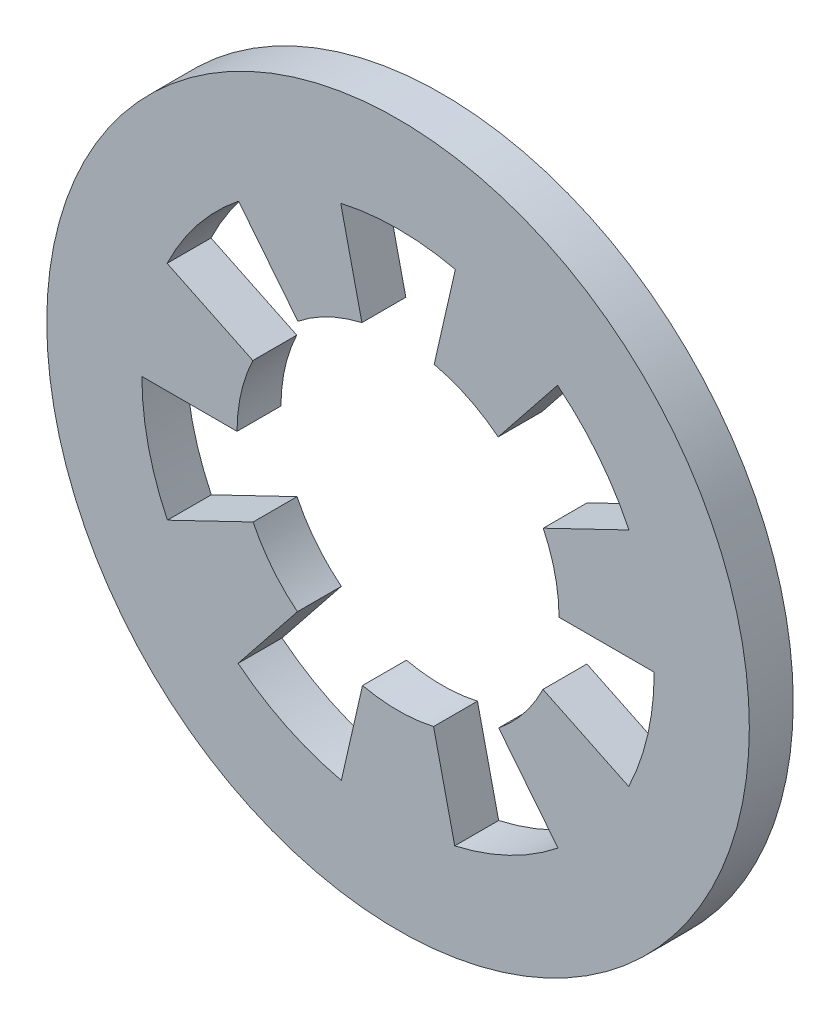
ISO-10303-21;
HEADER;
FILE_DESCRIPTION(('STEP AP214'),'2;1');
FILE_NAME('part.step','',(''),(''),'','','');
FILE_SCHEMA(('AUTOMOTIVE_DESIGN { 1 0 10303 214 1 1 1 1 }'));
ENDSEC;
DATA;
#1=APPLICATION_CONTEXT('core data for automotive mechanical design processes');
#2=APPLICATION_PROTOCOL_DEFINITION('international standard','automotive_design',2000,#1);
#3=PRODUCT_CONTEXT('',#1,'mechanical');
#4=PRODUCT('Part','Part','',(#3));
#5=PRODUCT_RELATED_PRODUCT_CATEGORY('part','',(#4));
#6=PRODUCT_DEFINITION_FORMATION('','',#4);
#7=PRODUCT_DEFINITION_CONTEXT('part definition',#1,'design');
#8=PRODUCT_DEFINITION('design','',#6,#7);
#9=PRODUCT_DEFINITION_SHAPE('','',#8);
#10=(LENGTH_UNIT() NAMED_UNIT(*) SI_UNIT(.MILLI.,.METRE.));
#11=(NAMED_UNIT(*) PLANE_ANGLE_UNIT() SI_UNIT($,.RADIAN.));
#12=(NAMED_UNIT(*) SI_UNIT($,.STERADIAN.) SOLID_ANGLE_UNIT());
#13=UNCERTAINTY_MEASURE_WITH_UNIT(LENGTH_MEASURE(1.E-05),#10,'distance_accuracy_value','');
#14=(GEOMETRIC_REPRESENTATION_CONTEXT(3) GLOBAL_UNCERTAINTY_ASSIGNED_CONTEXT((#13)) GLOBAL_UNIT_ASSIGNED_CONTEXT((#10,
#11,#12)) REPRESENTATION_CONTEXT('',''));
#15=CARTESIAN_POINT('',(0.,0.,0.));
#16=DIRECTION('',(0.,0.,1.));
#17=DIRECTION('',(1.,0.,0.));
#18=AXIS2_PLACEMENT_3D('',#15,#16,#17);
#19=CARTESIAN_POINT('',(0.,0.,0.));
#20=DIRECTION('',(0.,0.,1.));
#21=DIRECTION('',(1.,0.,0.));
#22=AXIS2_PLACEMENT_3D('',#19,#20,#21);
#23=CYLINDRICAL_SURFACE('',#22,1.1);
#24=DIRECTION('',(0.,0.,1.));
#25=VECTOR('',#24,1.);
#26=CARTESIAN_POINT('',(-0.684180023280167,0.861334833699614,-0.3));
#27=LINE('',#26,#25);
#28=CARTESIAN_POINT('',(-0.684180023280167,0.861334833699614,-0.3));
#29=VERTEX_POINT('',#28);
#30=CARTESIAN_POINT('',(-0.684180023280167,0.861334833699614,0.));
#31=VERTEX_POINT('',#30);
#32=EDGE_CURVE('E249',#29,#31,#27,.T.);
#33=ORIENTED_EDGE('',*,*,#32,.F.);
#34=CARTESIAN_POINT('',(0.,0.,-0.3));
#35=DIRECTION('',(0.,0.,1.));
#36=DIRECTION('',(1.,0.,0.));
#37=AXIS2_PLACEMENT_3D('',#34,#35,#36);
#38=CIRCLE('',#37,1.1);
#39=CARTESIAN_POINT('',(-0.246839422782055,1.07194696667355,-0.3));
#40=VERTEX_POINT('',#39);
#41=EDGE_CURVE('E11',#40,#29,#38,.T.);
#42=ORIENTED_EDGE('',*,*,#41,.F.);
#43=DIRECTION('',(0.,0.,1.));
#44=VECTOR('',#43,1.);
#45=CARTESIAN_POINT('',(-0.246839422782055,1.07194696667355,-0.3));
#46=LINE('',#45,#44);
#47=CARTESIAN_POINT('',(-0.246839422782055,1.07194696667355,0.));
#48=VERTEX_POINT('',#47);
#49=EDGE_CURVE('E408',#40,#48,#46,.T.);
#50=ORIENTED_EDGE('',*,*,#49,.T.);
#51=CARTESIAN_POINT('',(0.,0.,0.));
#52=DIRECTION('',(0.,0.,1.));
#53=DIRECTION('',(1.,0.,0.));
#54=AXIS2_PLACEMENT_3D('',#51,#52,#53);
#55=CIRCLE('',#54,1.1);
#56=EDGE_CURVE('E413',#48,#31,#55,.T.);
#57=ORIENTED_EDGE('',*,*,#56,.T.);
#58=EDGE_LOOP('',(#33,#42,#50,#57));
#59=FACE_BOUND('',#58,.T.);
#60=ADVANCED_FACE('F34',(#59),#23,.F.);
#61=DIRECTION('',(0.,0.,1.));
#62=VECTOR('',#61,1.);
#63=CARTESIAN_POINT('',(-0.991983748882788,0.475361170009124,-0.3));
#64=LINE('',#63,#62);
#65=CARTESIAN_POINT('',(-0.991983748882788,0.475361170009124,-0.3));
#66=VERTEX_POINT('',#65);
#67=CARTESIAN_POINT('',(-0.991983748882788,0.475361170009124,0.));
#68=VERTEX_POINT('',#67);
#69=EDGE_CURVE('E226',#66,#68,#64,.T.);
#70=ORIENTED_EDGE('',*,*,#69,.T.);
#71=CARTESIAN_POINT('',(-1.09999795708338,0.00212000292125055,0.));
#72=VERTEX_POINT('',#71);
#73=EDGE_CURVE('E417',#68,#72,#55,.T.);
#74=ORIENTED_EDGE('',*,*,#73,.T.);
#75=DIRECTION('',(0.,0.,1.));
#76=VECTOR('',#75,1.);
#77=CARTESIAN_POINT('',(-1.09999795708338,0.00212000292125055,-0.3));
#78=LINE('',#77,#76);
#79=CARTESIAN_POINT('',(-1.09999795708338,0.00212000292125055,-0.3));
#80=VERTEX_POINT('',#79);
#81=EDGE_CURVE('E271',#80,#72,#78,.T.);
#82=ORIENTED_EDGE('',*,*,#81,.F.);
#83=EDGE_CURVE('E42',#66,#80,#38,.T.);
#84=ORIENTED_EDGE('',*,*,#83,.F.);
#85=EDGE_LOOP('',(#70,#74,#82,#84));
#86=FACE_BOUND('',#85,.T.);
#87=ADVANCED_FACE('F444',(#86),#23,.F.);
#88=DIRECTION('',(0.,0.,1.));
#89=VECTOR('',#88,1.);
#90=CARTESIAN_POINT('',(-0.990144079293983,-0.479181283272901,-0.3));
#91=LINE('',#90,#89);
#92=CARTESIAN_POINT('',(-0.990144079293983,-0.479181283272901,-0.3));
#93=VERTEX_POINT('',#92);
#94=CARTESIAN_POINT('',(-0.990144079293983,-0.479181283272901,0.));
#95=VERTEX_POINT('',#94);
#96=EDGE_CURVE('E274',#93,#95,#91,.T.);
#97=ORIENTED_EDGE('',*,*,#96,.T.);
#98=CARTESIAN_POINT('',(-0.687494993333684,-0.858691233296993,0.));
#99=VERTEX_POINT('',#98);
#100=EDGE_CURVE('E447',#95,#99,#55,.T.);
#101=ORIENTED_EDGE('',*,*,#100,.T.);
#102=DIRECTION('',(0.,0.,1.));
#103=VECTOR('',#102,1.);
#104=CARTESIAN_POINT('',(-0.687494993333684,-0.858691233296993,-0.3));
#105=LINE('',#104,#103);
#106=CARTESIAN_POINT('',(-0.687494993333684,-0.858691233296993,-0.3));
#107=VERTEX_POINT('',#106);
#108=EDGE_CURVE('E297',#107,#99,#105,.T.);
#109=ORIENTED_EDGE('',*,*,#108,.F.);
#110=EDGE_CURVE('E432',#93,#107,#38,.T.);
#111=ORIENTED_EDGE('',*,*,#110,.F.);
#112=EDGE_LOOP('',(#97,#101,#109,#111));
#113=FACE_BOUND('',#112,.T.);
#114=ADVANCED_FACE('F500',(#113),#23,.F.);
#115=DIRECTION('',(0.,0.,1.));
#116=VECTOR('',#115,1.);
#117=CARTESIAN_POINT('',(-0.242705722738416,-1.07289045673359,-0.3));
#118=LINE('',#117,#116);
#119=CARTESIAN_POINT('',(-0.242705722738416,-1.07289045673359,-0.3));
#120=VERTEX_POINT('',#119);
#121=CARTESIAN_POINT('',(-0.242705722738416,-1.07289045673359,0.));
#122=VERTEX_POINT('',#121);
#123=EDGE_CURVE('E300',#120,#122,#118,.T.);
#124=ORIENTED_EDGE('',*,*,#123,.T.);
#125=CARTESIAN_POINT('',(0.242705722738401,-1.0728904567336,0.));
#126=VERTEX_POINT('',#125);
#127=EDGE_CURVE('E448',#122,#126,#55,.T.);
#128=ORIENTED_EDGE('',*,*,#127,.T.);
#129=DIRECTION('',(0.,0.,1.));
#130=VECTOR('',#129,1.);
#131=CARTESIAN_POINT('',(0.242705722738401,-1.0728904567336,-0.3));
#132=LINE('',#131,#130);
#133=CARTESIAN_POINT('',(0.242705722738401,-1.0728904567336,-0.3));
#134=VERTEX_POINT('',#133);
#135=EDGE_CURVE('E324',#134,#126,#132,.T.);
#136=ORIENTED_EDGE('',*,*,#135,.F.);
#137=EDGE_CURVE('E429',#120,#134,#38,.T.);
#138=ORIENTED_EDGE('',*,*,#137,.F.);
#139=EDGE_LOOP('',(#124,#128,#136,#138));
#140=FACE_BOUND('',#139,.T.);
#141=ADVANCED_FACE('F512',(#140),#23,.F.);
#142=DIRECTION('',(0.,0.,1.));
#143=VECTOR('',#142,1.);
#144=CARTESIAN_POINT('',(0.687494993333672,-0.858691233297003,-0.3));
#145=LINE('',#144,#143);
#146=CARTESIAN_POINT('',(0.687494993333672,-0.858691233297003,-0.3));
#147=VERTEX_POINT('',#146);
#148=CARTESIAN_POINT('',(0.687494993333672,-0.858691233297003,0.));
#149=VERTEX_POINT('',#148);
#150=EDGE_CURVE('E327',#147,#149,#145,.T.);
#151=ORIENTED_EDGE('',*,*,#150,.T.);
#152=CARTESIAN_POINT('',(0.990144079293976,-0.479181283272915,0.));
#153=VERTEX_POINT('',#152);
#154=EDGE_CURVE('E452',#149,#153,#55,.T.);
#155=ORIENTED_EDGE('',*,*,#154,.T.);
#156=DIRECTION('',(0.,0.,1.));
#157=VECTOR('',#156,1.);
#158=CARTESIAN_POINT('',(0.990144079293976,-0.479181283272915,-0.3));
#159=LINE('',#158,#157);
#160=CARTESIAN_POINT('',(0.990144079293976,-0.479181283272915,-0.3));
#161=VERTEX_POINT('',#160);
#162=EDGE_CURVE('E351',#161,#153,#159,.T.);
#163=ORIENTED_EDGE('',*,*,#162,.F.);
#164=EDGE_CURVE('E426',#147,#161,#38,.T.);
#165=ORIENTED_EDGE('',*,*,#164,.F.);
#166=EDGE_LOOP('',(#151,#155,#163,#165));
#167=FACE_BOUND('',#166,.T.);
#168=ADVANCED_FACE('F508',(#167),#23,.F.);
#169=DIRECTION('',(0.,0.,1.));
#170=VECTOR('',#169,1.);
#171=CARTESIAN_POINT('',(1.09999795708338,0.0021200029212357,-0.3));
#172=LINE('',#171,#170);
#173=CARTESIAN_POINT('',(1.09999795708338,0.0021200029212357,-0.3));
#174=VERTEX_POINT('',#173);
#175=CARTESIAN_POINT('',(1.09999795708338,0.0021200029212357,0.));
#176=VERTEX_POINT('',#175);
#177=EDGE_CURVE('E354',#174,#176,#172,.T.);
#178=ORIENTED_EDGE('',*,*,#177,.T.);
#179=CARTESIAN_POINT('',(0.991983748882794,0.47536117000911,0.));
#180=VERTEX_POINT('',#179);
#181=EDGE_CURVE('E456',#176,#180,#55,.T.);
#182=ORIENTED_EDGE('',*,*,#181,.T.);
#183=DIRECTION('',(0.,0.,1.));
#184=VECTOR('',#183,1.);
#185=CARTESIAN_POINT('',(0.991983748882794,0.47536117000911,-0.3));
#186=LINE('',#185,#184);
#187=CARTESIAN_POINT('',(0.991983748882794,0.47536117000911,-0.3));
#188=VERTEX_POINT('',#187);
#189=EDGE_CURVE('E378',#188,#180,#186,.T.);
#190=ORIENTED_EDGE('',*,*,#189,.F.);
#191=EDGE_CURVE('E423',#174,#188,#38,.T.);
#192=ORIENTED_EDGE('',*,*,#191,.F.);
#193=EDGE_LOOP('',(#178,#182,#190,#192));
#194=FACE_BOUND('',#193,.T.);
#195=ADVANCED_FACE('F502',(#194),#23,.F.);
#196=DIRECTION('',(0.,0.,1.));
#197=VECTOR('',#196,1.);
#198=CARTESIAN_POINT('',(0.68418002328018,0.861334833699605,-0.3));
#199=LINE('',#198,#197);
#200=CARTESIAN_POINT('',(0.68418002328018,0.861334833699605,-0.3));
#201=VERTEX_POINT('',#200);
#202=CARTESIAN_POINT('',(0.68418002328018,0.861334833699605,0.));
#203=VERTEX_POINT('',#202);
#204=EDGE_CURVE('E381',#201,#203,#199,.T.);
#205=ORIENTED_EDGE('',*,*,#204,.T.);
#206=CARTESIAN_POINT('',(0.246839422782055,1.07194696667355,0.));
#207=VERTEX_POINT('',#206);
#208=EDGE_CURVE('E404',#203,#207,#55,.T.);
#209=ORIENTED_EDGE('',*,*,#208,.T.);
#210=DIRECTION('',(0.,0.,1.));
#211=VECTOR('',#210,1.);
#212=CARTESIAN_POINT('',(0.246839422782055,1.07194696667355,-0.3));
#213=LINE('',#212,#211);
#214=CARTESIAN_POINT('',(0.246839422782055,1.07194696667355,-0.3));
#215=VERTEX_POINT('',#214);
#216=EDGE_CURVE('E405',#215,#207,#213,.T.);
#217=ORIENTED_EDGE('',*,*,#216,.F.);
#218=EDGE_CURVE('E43',#201,#215,#38,.T.);
#219=ORIENTED_EDGE('',*,*,#218,.F.);
#220=EDGE_LOOP('',(#205,#209,#217,#219));
#221=FACE_BOUND('',#220,.T.);
#222=ADVANCED_FACE('F36',(#221),#23,.F.);
#223=CARTESIAN_POINT('',(1.1,0.,-0.3));
#224=DIRECTION('',(0.,0.,-1.));
#225=DIRECTION('',(-1.,0.,0.));
#226=AXIS2_PLACEMENT_3D('',#223,#224,#225);
#227=PLANE('',#226);
#228=DIRECTION('',(-0.623489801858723,0.781831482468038,0.));
#229=VECTOR('',#228,1.);
#230=CARTESIAN_POINT('',(-1.08944886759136,1.36952589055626,-0.3));
#231=LINE('',#230,#229);
#232=CARTESIAN_POINT('',(-1.08944886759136,1.36952589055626,-0.3));
#233=VERTEX_POINT('',#232);
#234=EDGE_CURVE('E227',#29,#233,#231,.T.);
#235=ORIENTED_EDGE('',*,*,#234,.T.);
#236=CARTESIAN_POINT('',(0.,0.,-0.3));
#237=DIRECTION('',(0.,0.,1.));
#238=DIRECTION('',(-0.623489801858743,-0.781831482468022,0.));
#239=AXIS2_PLACEMENT_3D('',#236,#237,#238);
#240=CIRCLE('',#239,1.75000000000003);
#241=CARTESIAN_POINT('',(-1.57761419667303,0.757385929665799,-0.3));
#242=VERTEX_POINT('',#241);
#243=EDGE_CURVE('E222',#233,#242,#240,.T.);
#244=ORIENTED_EDGE('',*,*,#243,.T.);
#245=DIRECTION('',(0.900968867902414,-0.433883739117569,0.));
#246=VECTOR('',#245,1.);
#247=CARTESIAN_POINT('',(-1.57761419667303,0.757385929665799,-0.3));
#248=LINE('',#247,#246);
#249=EDGE_CURVE('E230',#242,#66,#248,.T.);
#250=ORIENTED_EDGE('',*,*,#249,.T.);
#251=ORIENTED_EDGE('',*,*,#83,.T.);
#252=DIRECTION('',(-1.,0.,0.));
#253=VECTOR('',#252,1.);
#254=CARTESIAN_POINT('',(-1.7499987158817,0.00212000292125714,-0.3));
#255=LINE('',#254,#253);
#256=CARTESIAN_POINT('',(-1.7499987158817,0.00212000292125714,-0.3));
#257=VERTEX_POINT('',#256);
#258=EDGE_CURVE('E259',#80,#257,#255,.T.);
#259=ORIENTED_EDGE('',*,*,#258,.T.);
#260=CARTESIAN_POINT('',(0.,0.,-0.3));
#261=DIRECTION('',(0.,0.,1.));
#262=DIRECTION('',(0.222520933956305,-0.974927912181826,0.));
#263=AXIS2_PLACEMENT_3D('',#260,#261,#262);
#264=CIRCLE('',#263,1.75000000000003);
#265=CARTESIAN_POINT('',(-1.57577452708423,-0.761206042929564,-0.3));
#266=VERTEX_POINT('',#265);
#267=EDGE_CURVE('E252',#257,#266,#264,.T.);
#268=ORIENTED_EDGE('',*,*,#267,.T.);
#269=DIRECTION('',(0.900968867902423,0.43388373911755,0.));
#270=VECTOR('',#269,1.);
#271=CARTESIAN_POINT('',(-1.57577452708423,-0.761206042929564,-0.3));
#272=LINE('',#271,#270);
#273=EDGE_CURVE('E255',#266,#93,#272,.T.);
#274=ORIENTED_EDGE('',*,*,#273,.T.);
#275=ORIENTED_EDGE('',*,*,#110,.T.);
#276=DIRECTION('',(-0.62348980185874,-0.781831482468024,0.));
#277=VECTOR('',#276,1.);
#278=CARTESIAN_POINT('',(-1.09276383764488,-1.36688229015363,-0.3));
#279=LINE('',#278,#277);
#280=CARTESIAN_POINT('',(-1.09276383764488,-1.36688229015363,-0.3));
#281=VERTEX_POINT('',#280);
#282=EDGE_CURVE('E285',#107,#281,#279,.T.);
#283=ORIENTED_EDGE('',*,*,#282,.T.);
#284=CARTESIAN_POINT('',(0.,0.,-0.3));
#285=DIRECTION('',(0.,0.,1.));
#286=DIRECTION('',(0.900968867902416,-0.433883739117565,0.));
#287=AXIS2_PLACEMENT_3D('',#284,#285,#286);
#288=CIRCLE('',#287,1.75000000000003);
#289=CARTESIAN_POINT('',(-0.387344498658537,-1.70659433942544,-0.3));
#290=VERTEX_POINT('',#289);
#291=EDGE_CURVE('E278',#281,#290,#288,.T.);
#292=ORIENTED_EDGE('',*,*,#291,.T.);
#293=DIRECTION('',(0.222520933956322,0.974927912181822,0.));
#294=VECTOR('',#293,1.);
#295=CARTESIAN_POINT('',(-0.387344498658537,-1.70659433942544,-0.3));
#296=LINE('',#295,#294);
#297=EDGE_CURVE('E281',#290,#120,#296,.T.);
#298=ORIENTED_EDGE('',*,*,#297,.T.);
#299=ORIENTED_EDGE('',*,*,#137,.T.);
#300=DIRECTION('',(0.222520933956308,-0.974927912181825,0.));
#301=VECTOR('',#300,1.);
#302=CARTESIAN_POINT('',(0.387344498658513,-1.70659433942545,-0.3));
#303=LINE('',#302,#301);
#304=CARTESIAN_POINT('',(0.387344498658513,-1.70659433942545,-0.3));
#305=VERTEX_POINT('',#304);
#306=EDGE_CURVE('E312',#134,#305,#303,.T.);
#307=ORIENTED_EDGE('',*,*,#306,.T.);
#308=CARTESIAN_POINT('',(0.,0.,-0.3));
#309=DIRECTION('',(0.,0.,1.));
#310=DIRECTION('',(0.900968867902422,0.433883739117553,0.));
#311=AXIS2_PLACEMENT_3D('',#308,#309,#310);
#312=CIRCLE('',#311,1.75000000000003);
#313=CARTESIAN_POINT('',(1.09276383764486,-1.36688229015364,-0.3));
#314=VERTEX_POINT('',#313);
#315=EDGE_CURVE('E305',#305,#314,#312,.T.);
#316=ORIENTED_EDGE('',*,*,#315,.T.);
#317=DIRECTION('',(-0.623489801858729,0.781831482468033,0.));
#318=VECTOR('',#317,1.);
#319=CARTESIAN_POINT('',(1.09276383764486,-1.36688229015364,-0.3));
#320=LINE('',#319,#318);
#321=EDGE_CURVE('E308',#314,#147,#320,.T.);
#322=ORIENTED_EDGE('',*,*,#321,.T.);
#323=ORIENTED_EDGE('',*,*,#164,.T.);
#324=DIRECTION('',(0.900968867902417,-0.433883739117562,0.));
#325=VECTOR('',#324,1.);
#326=CARTESIAN_POINT('',(1.57577452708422,-0.761206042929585,-0.3));
#327=LINE('',#326,#325);
#328=CARTESIAN_POINT('',(1.57577452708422,-0.761206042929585,-0.3));
#329=VERTEX_POINT('',#328);
#330=EDGE_CURVE('E339',#161,#329,#327,.T.);
#331=ORIENTED_EDGE('',*,*,#330,.T.);
#332=CARTESIAN_POINT('',(0.,0.,-0.3));
#333=DIRECTION('',(0.,0.,1.));
#334=DIRECTION('',(0.222520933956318,0.974927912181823,0.));
#335=AXIS2_PLACEMENT_3D('',#332,#333,#334);
#336=CIRCLE('',#335,1.75000000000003);
#337=CARTESIAN_POINT('',(1.7499987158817,0.00212000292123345,-0.3));
#338=VERTEX_POINT('',#337);
#339=EDGE_CURVE('E332',#329,#338,#336,.T.);
#340=ORIENTED_EDGE('',*,*,#339,.T.);
#341=DIRECTION('',(-1.,0.,0.));
#342=VECTOR('',#341,1.);
#343=CARTESIAN_POINT('',(1.7499987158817,0.00212000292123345,-0.3));
#344=LINE('',#343,#342);
#345=EDGE_CURVE('E335',#338,#174,#344,.T.);
#346=ORIENTED_EDGE('',*,*,#345,.T.);
#347=ORIENTED_EDGE('',*,*,#191,.T.);
#348=DIRECTION('',(0.90096886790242,0.433883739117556,0.));
#349=VECTOR('',#348,1.);
#350=CARTESIAN_POINT('',(1.57761419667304,0.757385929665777,-0.3));
#351=LINE('',#350,#349);
#352=CARTESIAN_POINT('',(1.57761419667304,0.757385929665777,-0.3));
#353=VERTEX_POINT('',#352);
#354=EDGE_CURVE('E366',#188,#353,#351,.T.);
#355=ORIENTED_EDGE('',*,*,#354,.T.);
#356=CARTESIAN_POINT('',(0.,0.,-0.3));
#357=DIRECTION('',(0.,0.,1.));
#358=DIRECTION('',(-0.623489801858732,0.781831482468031,0.));
#359=AXIS2_PLACEMENT_3D('',#356,#357,#358);
#360=CIRCLE('',#359,1.75000000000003);
#361=CARTESIAN_POINT('',(1.08944886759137,1.36952589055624,-0.3));
#362=VERTEX_POINT('',#361);
#363=EDGE_CURVE('E359',#353,#362,#360,.T.);
#364=ORIENTED_EDGE('',*,*,#363,.T.);
#365=DIRECTION('',(-0.623489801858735,-0.781831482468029,0.));
#366=VECTOR('',#365,1.);
#367=CARTESIAN_POINT('',(1.08944886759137,1.36952589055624,-0.3));
#368=LINE('',#367,#366);
#369=EDGE_CURVE('E362',#362,#201,#368,.T.);
#370=ORIENTED_EDGE('',*,*,#369,.T.);
#371=ORIENTED_EDGE('',*,*,#218,.T.);
#372=DIRECTION('',(0.222520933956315,0.974927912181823,0.));
#373=VECTOR('',#372,1.);
#374=CARTESIAN_POINT('',(0.391478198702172,1.7056508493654,-0.3));
#375=LINE('',#374,#373);
#376=CARTESIAN_POINT('',(0.391478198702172,1.7056508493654,-0.3));
#377=VERTEX_POINT('',#376);
#378=EDGE_CURVE('E393',#215,#377,#375,.T.);
#379=ORIENTED_EDGE('',*,*,#378,.T.);
#380=CARTESIAN_POINT('',(0.,0.,-0.3));
#381=DIRECTION('',(0.,0.,1.));
#382=DIRECTION('',(-1.,0.,0.));
#383=AXIS2_PLACEMENT_3D('',#380,#381,#382);
#384=CIRCLE('',#383,1.75000000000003);
#385=CARTESIAN_POINT('',(-0.391478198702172,1.7056508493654,-0.3));
#386=VERTEX_POINT('',#385);
#387=EDGE_CURVE('E386',#377,#386,#384,.T.);
#388=ORIENTED_EDGE('',*,*,#387,.T.);
#389=DIRECTION('',(0.222520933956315,-0.974927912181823,0.));
#390=VECTOR('',#389,1.);
#391=CARTESIAN_POINT('',(-0.391478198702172,1.7056508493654,-0.3));
#392=LINE('',#391,#390);
#393=EDGE_CURVE('E389',#386,#40,#392,.T.);
#394=ORIENTED_EDGE('',*,*,#393,.T.);
#395=ORIENTED_EDGE('',*,*,#41,.T.);
#396=EDGE_LOOP('',(#235,#244,#250,#251,#259,#268,#274,#275,#283,#292,#298,#299,#307,#316,#322,
#323,#331,#340,#346,#347,#355,#364,#370,#371,#379,#388,#394,#395));
#397=FACE_BOUND('',#396,.T.);
#398=CARTESIAN_POINT('',(0.,0.,-0.3));
#399=DIRECTION('',(0.,0.,1.));
#400=DIRECTION('',(1.,0.,0.));
#401=AXIS2_PLACEMENT_3D('',#398,#399,#400);
#402=CIRCLE('',#401,2.4);
#403=CARTESIAN_POINT('',(2.4,0.,-0.3));
#404=VERTEX_POINT('',#403);
#405=EDGE_CURVE('E419',#404,#404,#402,.T.);
#406=ORIENTED_EDGE('',*,*,#405,.F.);
#407=EDGE_LOOP('',(#406));
#408=FACE_BOUND('',#407,.T.);
#409=ADVANCED_FACE('F236',(#397,#408),#227,.T.);
#410=CARTESIAN_POINT('',(0.,0.,0.));
#411=DIRECTION('',(0.,0.,1.));
#412=DIRECTION('',(1.,0.,0.));
#413=AXIS2_PLACEMENT_3D('',#410,#411,#412);
#414=CYLINDRICAL_SURFACE('',#413,2.4);
#415=ORIENTED_EDGE('',*,*,#405,.T.);
#416=EDGE_LOOP('',(#415));
#417=FACE_BOUND('',#416,.T.);
#418=CARTESIAN_POINT('',(0.,0.,0.));
#419=DIRECTION('',(0.,0.,1.));
#420=DIRECTION('',(1.,0.,0.));
#421=AXIS2_PLACEMENT_3D('',#418,#419,#420);
#422=CIRCLE('',#421,2.4);
#423=CARTESIAN_POINT('',(2.4,0.,0.));
#424=VERTEX_POINT('',#423);
#425=EDGE_CURVE('E416',#424,#424,#422,.T.);
#426=ORIENTED_EDGE('',*,*,#425,.F.);
#427=EDGE_LOOP('',(#426));
#428=FACE_BOUND('',#427,.T.);
#429=ADVANCED_FACE('F507',(#417,#428),#414,.T.);
#430=CARTESIAN_POINT('',(1.1,0.,0.));
#431=DIRECTION('',(0.,0.,1.));
#432=DIRECTION('',(1.,0.,0.));
#433=AXIS2_PLACEMENT_3D('',#430,#431,#432);
#434=PLANE('',#433);
#435=DIRECTION('',(-0.623489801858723,0.781831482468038,0.));
#436=VECTOR('',#435,1.);
#437=CARTESIAN_POINT('',(-1.08944886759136,1.36952589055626,0.));
#438=LINE('',#437,#436);
#439=CARTESIAN_POINT('',(-1.08944886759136,1.36952589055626,0.));
#440=VERTEX_POINT('',#439);
#441=EDGE_CURVE('E238',#31,#440,#438,.T.);
#442=ORIENTED_EDGE('',*,*,#441,.F.);
#443=ORIENTED_EDGE('',*,*,#56,.F.);
#444=DIRECTION('',(0.222520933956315,-0.974927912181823,0.));
#445=VECTOR('',#444,1.);
#446=CARTESIAN_POINT('',(-0.391478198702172,1.7056508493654,0.));
#447=LINE('',#446,#445);
#448=CARTESIAN_POINT('',(-0.391478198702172,1.7056508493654,0.));
#449=VERTEX_POINT('',#448);
#450=EDGE_CURVE('E398',#449,#48,#447,.T.);
#451=ORIENTED_EDGE('',*,*,#450,.F.);
#452=CARTESIAN_POINT('',(0.,0.,0.));
#453=DIRECTION('',(0.,0.,1.));
#454=DIRECTION('',(-1.,0.,0.));
#455=AXIS2_PLACEMENT_3D('',#452,#453,#454);
#456=CIRCLE('',#455,1.75000000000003);
#457=CARTESIAN_POINT('',(0.391478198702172,1.7056508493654,0.));
#458=VERTEX_POINT('',#457);
#459=EDGE_CURVE('E377',#458,#449,#456,.T.);
#460=ORIENTED_EDGE('',*,*,#459,.F.);
#461=DIRECTION('',(0.222520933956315,0.974927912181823,0.));
#462=VECTOR('',#461,1.);
#463=CARTESIAN_POINT('',(0.391478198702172,1.7056508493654,0.));
#464=LINE('',#463,#462);
#465=EDGE_CURVE('E390',#207,#458,#464,.T.);
#466=ORIENTED_EDGE('',*,*,#465,.F.);
#467=ORIENTED_EDGE('',*,*,#208,.F.);
#468=DIRECTION('',(-0.623489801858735,-0.781831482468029,0.));
#469=VECTOR('',#468,1.);
#470=CARTESIAN_POINT('',(1.08944886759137,1.36952589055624,0.));
#471=LINE('',#470,#469);
#472=CARTESIAN_POINT('',(1.08944886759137,1.36952589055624,0.));
#473=VERTEX_POINT('',#472);
#474=EDGE_CURVE('E371',#473,#203,#471,.T.);
#475=ORIENTED_EDGE('',*,*,#474,.F.);
#476=CARTESIAN_POINT('',(0.,0.,0.));
#477=DIRECTION('',(0.,0.,1.));
#478=DIRECTION('',(-0.623489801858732,0.781831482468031,0.));
#479=AXIS2_PLACEMENT_3D('',#476,#477,#478);
#480=CIRCLE('',#479,1.75000000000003);
#481=CARTESIAN_POINT('',(1.57761419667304,0.757385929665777,0.));
#482=VERTEX_POINT('',#481);
#483=EDGE_CURVE('E350',#482,#473,#480,.T.);
#484=ORIENTED_EDGE('',*,*,#483,.F.);
#485=DIRECTION('',(0.90096886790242,0.433883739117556,0.));
#486=VECTOR('',#485,1.);
#487=CARTESIAN_POINT('',(1.57761419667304,0.757385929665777,0.));
#488=LINE('',#487,#486);
#489=EDGE_CURVE('E363',#180,#482,#488,.T.);
#490=ORIENTED_EDGE('',*,*,#489,.F.);
#491=ORIENTED_EDGE('',*,*,#181,.F.);
#492=DIRECTION('',(-1.,0.,0.));
#493=VECTOR('',#492,1.);
#494=CARTESIAN_POINT('',(1.7499987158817,0.00212000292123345,0.));
#495=LINE('',#494,#493);
#496=CARTESIAN_POINT('',(1.7499987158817,0.00212000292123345,0.));
#497=VERTEX_POINT('',#496);
#498=EDGE_CURVE('E344',#497,#176,#495,.T.);
#499=ORIENTED_EDGE('',*,*,#498,.F.);
#500=CARTESIAN_POINT('',(0.,0.,0.));
#501=DIRECTION('',(0.,0.,1.));
#502=DIRECTION('',(0.222520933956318,0.974927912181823,0.));
#503=AXIS2_PLACEMENT_3D('',#500,#501,#502);
#504=CIRCLE('',#503,1.75000000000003);
#505=CARTESIAN_POINT('',(1.57577452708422,-0.761206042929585,0.));
#506=VERTEX_POINT('',#505);
#507=EDGE_CURVE('E323',#506,#497,#504,.T.);
#508=ORIENTED_EDGE('',*,*,#507,.F.);
#509=DIRECTION('',(0.900968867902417,-0.433883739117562,0.));
#510=VECTOR('',#509,1.);
#511=CARTESIAN_POINT('',(1.57577452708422,-0.761206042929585,0.));
#512=LINE('',#511,#510);
#513=EDGE_CURVE('E336',#153,#506,#512,.T.);
#514=ORIENTED_EDGE('',*,*,#513,.F.);
#515=ORIENTED_EDGE('',*,*,#154,.F.);
#516=DIRECTION('',(-0.623489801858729,0.781831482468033,0.));
#517=VECTOR('',#516,1.);
#518=CARTESIAN_POINT('',(1.09276383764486,-1.36688229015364,0.));
#519=LINE('',#518,#517);
#520=CARTESIAN_POINT('',(1.09276383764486,-1.36688229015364,0.));
#521=VERTEX_POINT('',#520);
#522=EDGE_CURVE('E317',#521,#149,#519,.T.);
#523=ORIENTED_EDGE('',*,*,#522,.F.);
#524=CARTESIAN_POINT('',(0.,0.,0.));
#525=DIRECTION('',(0.,0.,1.));
#526=DIRECTION('',(0.900968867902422,0.433883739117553,0.));
#527=AXIS2_PLACEMENT_3D('',#524,#525,#526);
#528=CIRCLE('',#527,1.75000000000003);
#529=CARTESIAN_POINT('',(0.387344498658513,-1.70659433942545,0.));
#530=VERTEX_POINT('',#529);
#531=EDGE_CURVE('E296',#530,#521,#528,.T.);
#532=ORIENTED_EDGE('',*,*,#531,.F.);
#533=DIRECTION('',(0.222520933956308,-0.974927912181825,0.));
#534=VECTOR('',#533,1.);
#535=CARTESIAN_POINT('',(0.387344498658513,-1.70659433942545,0.));
#536=LINE('',#535,#534);
#537=EDGE_CURVE('E309',#126,#530,#536,.T.);
#538=ORIENTED_EDGE('',*,*,#537,.F.);
#539=ORIENTED_EDGE('',*,*,#127,.F.);
#540=DIRECTION('',(0.222520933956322,0.974927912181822,0.));
#541=VECTOR('',#540,1.);
#542=CARTESIAN_POINT('',(-0.387344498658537,-1.70659433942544,0.));
#543=LINE('',#542,#541);
#544=CARTESIAN_POINT('',(-0.387344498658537,-1.70659433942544,0.));
#545=VERTEX_POINT('',#544);
#546=EDGE_CURVE('E290',#545,#122,#543,.T.);
#547=ORIENTED_EDGE('',*,*,#546,.F.);
#548=CARTESIAN_POINT('',(0.,0.,0.));
#549=DIRECTION('',(0.,0.,1.));
#550=DIRECTION('',(0.900968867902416,-0.433883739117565,0.));
#551=AXIS2_PLACEMENT_3D('',#548,#549,#550);
#552=CIRCLE('',#551,1.75000000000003);
#553=CARTESIAN_POINT('',(-1.09276383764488,-1.36688229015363,0.));
#554=VERTEX_POINT('',#553);
#555=EDGE_CURVE('E270',#554,#545,#552,.T.);
#556=ORIENTED_EDGE('',*,*,#555,.F.);
#557=DIRECTION('',(-0.62348980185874,-0.781831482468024,0.));
#558=VECTOR('',#557,1.);
#559=CARTESIAN_POINT('',(-1.09276383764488,-1.36688229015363,0.));
#560=LINE('',#559,#558);
#561=EDGE_CURVE('E282',#99,#554,#560,.T.);
#562=ORIENTED_EDGE('',*,*,#561,.F.);
#563=ORIENTED_EDGE('',*,*,#100,.F.);
#564=DIRECTION('',(0.900968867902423,0.43388373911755,0.));
#565=VECTOR('',#564,1.);
#566=CARTESIAN_POINT('',(-1.57577452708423,-0.761206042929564,0.));
#567=LINE('',#566,#565);
#568=CARTESIAN_POINT('',(-1.57577452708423,-0.761206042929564,0.));
#569=VERTEX_POINT('',#568);
#570=EDGE_CURVE('E264',#569,#95,#567,.T.);
#571=ORIENTED_EDGE('',*,*,#570,.F.);
#572=CARTESIAN_POINT('',(0.,0.,0.));
#573=DIRECTION('',(0.,0.,1.));
#574=DIRECTION('',(0.222520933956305,-0.974927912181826,0.));
#575=AXIS2_PLACEMENT_3D('',#572,#573,#574);
#576=CIRCLE('',#575,1.75000000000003);
#577=CARTESIAN_POINT('',(-1.7499987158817,0.00212000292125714,0.));
#578=VERTEX_POINT('',#577);
#579=EDGE_CURVE('E58',#578,#569,#576,.T.);
#580=ORIENTED_EDGE('',*,*,#579,.F.);
#581=DIRECTION('',(-1.,0.,0.));
#582=VECTOR('',#581,1.);
#583=CARTESIAN_POINT('',(-1.7499987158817,0.00212000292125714,0.));
#584=LINE('',#583,#582);
#585=EDGE_CURVE('E256',#72,#578,#584,.T.);
#586=ORIENTED_EDGE('',*,*,#585,.F.);
#587=ORIENTED_EDGE('',*,*,#73,.F.);
#588=DIRECTION('',(0.900968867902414,-0.433883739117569,0.));
#589=VECTOR('',#588,1.);
#590=CARTESIAN_POINT('',(-1.57761419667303,0.757385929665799,0.));
#591=LINE('',#590,#589);
#592=CARTESIAN_POINT('',(-1.57761419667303,0.757385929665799,0.));
#593=VERTEX_POINT('',#592);
#594=EDGE_CURVE('E241',#593,#68,#591,.T.);
#595=ORIENTED_EDGE('',*,*,#594,.F.);
#596=CARTESIAN_POINT('',(0.,0.,0.));
#597=DIRECTION('',(0.,0.,1.));
#598=DIRECTION('',(-0.623489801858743,-0.781831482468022,0.));
#599=AXIS2_PLACEMENT_3D('',#596,#597,#598);
#600=CIRCLE('',#599,1.75000000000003);
#601=EDGE_CURVE('E50',#440,#593,#600,.T.);
#602=ORIENTED_EDGE('',*,*,#601,.F.);
#603=EDGE_LOOP('',(#442,#443,#451,#460,#466,#467,#475,#484,#490,#491,#499,#508,#514,#515,#523,
#532,#538,#539,#547,#556,#562,#563,#571,#580,#586,#587,#595,#602));
#604=FACE_BOUND('',#603,.T.);
#605=ORIENTED_EDGE('',*,*,#425,.T.);
#606=EDGE_LOOP('',(#605));
#607=FACE_BOUND('',#606,.T.);
#608=ADVANCED_FACE('F472',(#604,#607),#434,.T.);
#609=CARTESIAN_POINT('',(0.,0.,-0.3));
#610=DIRECTION('',(0.,0.,1.));
#611=DIRECTION('',(1.,0.,0.));
#612=AXIS2_PLACEMENT_3D('',#609,#610,#611);
#613=CYLINDRICAL_SURFACE('',#612,1.75000000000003);
#614=ORIENTED_EDGE('',*,*,#459,.T.);
#615=DIRECTION('',(0.,0.,1.));
#616=VECTOR('',#615,1.);
#617=CARTESIAN_POINT('',(-0.391478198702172,1.7056508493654,-0.3));
#618=LINE('',#617,#616);
#619=EDGE_CURVE('E396',#386,#449,#618,.T.);
#620=ORIENTED_EDGE('',*,*,#619,.F.);
#621=ORIENTED_EDGE('',*,*,#387,.F.);
#622=DIRECTION('',(0.,0.,1.));
#623=VECTOR('',#622,1.);
#624=CARTESIAN_POINT('',(0.391478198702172,1.7056508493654,-0.3));
#625=LINE('',#624,#623);
#626=EDGE_CURVE('E402',#377,#458,#625,.T.);
#627=ORIENTED_EDGE('',*,*,#626,.T.);
#628=EDGE_LOOP('',(#614,#620,#621,#627));
#629=FACE_BOUND('',#628,.T.);
#630=ADVANCED_FACE('F477',(#629),#613,.F.);
#631=CARTESIAN_POINT('',(0.391478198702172,1.7056508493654,-0.3));
#632=DIRECTION('',(0.974927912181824,-0.222520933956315,0.));
#633=DIRECTION('',(0.222520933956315,0.974927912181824,0.));
#634=AXIS2_PLACEMENT_3D('',#631,#632,#633);
#635=PLANE('',#634);
#636=ORIENTED_EDGE('',*,*,#465,.T.);
#637=ORIENTED_EDGE('',*,*,#626,.F.);
#638=ORIENTED_EDGE('',*,*,#378,.F.);
#639=ORIENTED_EDGE('',*,*,#216,.T.);
#640=EDGE_LOOP('',(#636,#637,#638,#639));
#641=FACE_BOUND('',#640,.T.);
#642=ADVANCED_FACE('F469',(#641),#635,.F.);
#643=CARTESIAN_POINT('',(-0.391478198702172,1.7056508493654,-0.3));
#644=DIRECTION('',(-0.974927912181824,-0.222520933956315,0.));
#645=DIRECTION('',(0.222520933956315,-0.974927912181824,0.));
#646=AXIS2_PLACEMENT_3D('',#643,#644,#645);
#647=PLANE('',#646);
#648=ORIENTED_EDGE('',*,*,#450,.T.);
#649=ORIENTED_EDGE('',*,*,#49,.F.);
#650=ORIENTED_EDGE('',*,*,#393,.F.);
#651=ORIENTED_EDGE('',*,*,#619,.T.);
#652=EDGE_LOOP('',(#648,#649,#650,#651));
#653=FACE_BOUND('',#652,.T.);
#654=ADVANCED_FACE('F481',(#653),#647,.F.);
#655=CARTESIAN_POINT('',(0.,0.,-0.3));
#656=DIRECTION('',(0.,0.,1.));
#657=DIRECTION('',(1.,0.,0.));
#658=AXIS2_PLACEMENT_3D('',#655,#656,#657);
#659=CYLINDRICAL_SURFACE('',#658,1.75000000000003);
#660=ORIENTED_EDGE('',*,*,#483,.T.);
#661=DIRECTION('',(0.,0.,1.));
#662=VECTOR('',#661,1.);
#663=CARTESIAN_POINT('',(1.08944886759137,1.36952589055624,-0.3));
#664=LINE('',#663,#662);
#665=EDGE_CURVE('E369',#362,#473,#664,.T.);
#666=ORIENTED_EDGE('',*,*,#665,.F.);
#667=ORIENTED_EDGE('',*,*,#363,.F.);
#668=DIRECTION('',(0.,0.,1.));
#669=VECTOR('',#668,1.);
#670=CARTESIAN_POINT('',(1.57761419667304,0.757385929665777,-0.3));
#671=LINE('',#670,#669);
#672=EDGE_CURVE('E375',#353,#482,#671,.T.);
#673=ORIENTED_EDGE('',*,*,#672,.T.);
#674=EDGE_LOOP('',(#660,#666,#667,#673));
#675=FACE_BOUND('',#674,.T.);
#676=ADVANCED_FACE('F524',(#675),#659,.F.);
#677=CARTESIAN_POINT('',(1.57761419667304,0.757385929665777,-0.3));
#678=DIRECTION('',(0.433883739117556,-0.90096886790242,0.));
#679=DIRECTION('',(0.90096886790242,0.433883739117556,0.));
#680=AXIS2_PLACEMENT_3D('',#677,#678,#679);
#681=PLANE('',#680);
#682=ORIENTED_EDGE('',*,*,#489,.T.);
#683=ORIENTED_EDGE('',*,*,#672,.F.);
#684=ORIENTED_EDGE('',*,*,#354,.F.);
#685=ORIENTED_EDGE('',*,*,#189,.T.);
#686=EDGE_LOOP('',(#682,#683,#684,#685));
#687=FACE_BOUND('',#686,.T.);
#688=ADVANCED_FACE('F520',(#687),#681,.F.);
#689=CARTESIAN_POINT('',(1.08944886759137,1.36952589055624,-0.3));
#690=DIRECTION('',(-0.781831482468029,0.623489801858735,0.));
#691=DIRECTION('',(-0.623489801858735,-0.781831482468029,0.));
#692=AXIS2_PLACEMENT_3D('',#689,#690,#691);
#693=PLANE('',#692);
#694=ORIENTED_EDGE('',*,*,#474,.T.);
#695=ORIENTED_EDGE('',*,*,#204,.F.);
#696=ORIENTED_EDGE('',*,*,#369,.F.);
#697=ORIENTED_EDGE('',*,*,#665,.T.);
#698=EDGE_LOOP('',(#694,#695,#696,#697));
#699=FACE_BOUND('',#698,.T.);
#700=ADVANCED_FACE('F526',(#699),#693,.F.);
#701=CARTESIAN_POINT('',(0.,0.,-0.3));
#702=DIRECTION('',(0.,0.,1.));
#703=DIRECTION('',(1.,0.,0.));
#704=AXIS2_PLACEMENT_3D('',#701,#702,#703);
#705=CYLINDRICAL_SURFACE('',#704,1.75000000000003);
#706=ORIENTED_EDGE('',*,*,#507,.T.);
#707=DIRECTION('',(0.,0.,1.));
#708=VECTOR('',#707,1.);
#709=CARTESIAN_POINT('',(1.7499987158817,0.00212000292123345,-0.3));
#710=LINE('',#709,#708);
#711=EDGE_CURVE('E342',#338,#497,#710,.T.);
#712=ORIENTED_EDGE('',*,*,#711,.F.);
#713=ORIENTED_EDGE('',*,*,#339,.F.);
#714=DIRECTION('',(0.,0.,1.));
#715=VECTOR('',#714,1.);
#716=CARTESIAN_POINT('',(1.57577452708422,-0.761206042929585,-0.3));
#717=LINE('',#716,#715);
#718=EDGE_CURVE('E348',#329,#506,#717,.T.);
#719=ORIENTED_EDGE('',*,*,#718,.T.);
#720=EDGE_LOOP('',(#706,#712,#713,#719));
#721=FACE_BOUND('',#720,.T.);
#722=ADVANCED_FACE('F528',(#721),#705,.F.);
#723=CARTESIAN_POINT('',(1.57577452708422,-0.761206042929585,-0.3));
#724=DIRECTION('',(-0.433883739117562,-0.900968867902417,0.));
#725=DIRECTION('',(0.900968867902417,-0.433883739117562,0.));
#726=AXIS2_PLACEMENT_3D('',#723,#724,#725);
#727=PLANE('',#726);
#728=ORIENTED_EDGE('',*,*,#513,.T.);
#729=ORIENTED_EDGE('',*,*,#718,.F.);
#730=ORIENTED_EDGE('',*,*,#330,.F.);
#731=ORIENTED_EDGE('',*,*,#162,.T.);
#732=EDGE_LOOP('',(#728,#729,#730,#731));
#733=FACE_BOUND('',#732,.T.);
#734=ADVANCED_FACE('F534',(#733),#727,.F.);
#735=CARTESIAN_POINT('',(1.7499987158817,0.00212000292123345,-0.3));
#736=DIRECTION('',(0.,1.,0.));
#737=DIRECTION('',(-1.,0.,0.));
#738=AXIS2_PLACEMENT_3D('',#735,#736,#737);
#739=PLANE('',#738);
#740=ORIENTED_EDGE('',*,*,#498,.T.);
#741=ORIENTED_EDGE('',*,*,#177,.F.);
#742=ORIENTED_EDGE('',*,*,#345,.F.);
#743=ORIENTED_EDGE('',*,*,#711,.T.);
#744=EDGE_LOOP('',(#740,#741,#742,#743));
#745=FACE_BOUND('',#744,.T.);
#746=ADVANCED_FACE('F612',(#745),#739,.F.);
#747=CARTESIAN_POINT('',(0.,0.,-0.3));
#748=DIRECTION('',(0.,0.,1.));
#749=DIRECTION('',(1.,0.,0.));
#750=AXIS2_PLACEMENT_3D('',#747,#748,#749);
#751=CYLINDRICAL_SURFACE('',#750,1.75000000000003);
#752=ORIENTED_EDGE('',*,*,#531,.T.);
#753=DIRECTION('',(0.,0.,1.));
#754=VECTOR('',#753,1.);
#755=CARTESIAN_POINT('',(1.09276383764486,-1.36688229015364,-0.3));
#756=LINE('',#755,#754);
#757=EDGE_CURVE('E315',#314,#521,#756,.T.);
#758=ORIENTED_EDGE('',*,*,#757,.F.);
#759=ORIENTED_EDGE('',*,*,#315,.F.);
#760=DIRECTION('',(0.,0.,1.));
#761=VECTOR('',#760,1.);
#762=CARTESIAN_POINT('',(0.387344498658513,-1.70659433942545,-0.3));
#763=LINE('',#762,#761);
#764=EDGE_CURVE('E321',#305,#530,#763,.T.);
#765=ORIENTED_EDGE('',*,*,#764,.T.);
#766=EDGE_LOOP('',(#752,#758,#759,#765));
#767=FACE_BOUND('',#766,.T.);
#768=ADVANCED_FACE('F607',(#767),#751,.F.);
#769=CARTESIAN_POINT('',(0.387344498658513,-1.70659433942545,-0.3));
#770=DIRECTION('',(-0.974927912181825,-0.222520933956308,0.));
#771=DIRECTION('',(0.222520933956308,-0.974927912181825,0.));
#772=AXIS2_PLACEMENT_3D('',#769,#770,#771);
#773=PLANE('',#772);
#774=ORIENTED_EDGE('',*,*,#537,.T.);
#775=ORIENTED_EDGE('',*,*,#764,.F.);
#776=ORIENTED_EDGE('',*,*,#306,.F.);
#777=ORIENTED_EDGE('',*,*,#135,.T.);
#778=EDGE_LOOP('',(#774,#775,#776,#777));
#779=FACE_BOUND('',#778,.T.);
#780=ADVANCED_FACE('F611',(#779),#773,.F.);
#781=CARTESIAN_POINT('',(1.09276383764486,-1.36688229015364,-0.3));
#782=DIRECTION('',(0.781831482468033,0.623489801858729,0.));
#783=DIRECTION('',(-0.623489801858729,0.781831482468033,0.));
#784=AXIS2_PLACEMENT_3D('',#781,#782,#783);
#785=PLANE('',#784);
#786=ORIENTED_EDGE('',*,*,#522,.T.);
#787=ORIENTED_EDGE('',*,*,#150,.F.);
#788=ORIENTED_EDGE('',*,*,#321,.F.);
#789=ORIENTED_EDGE('',*,*,#757,.T.);
#790=EDGE_LOOP('',(#786,#787,#788,#789));
#791=FACE_BOUND('',#790,.T.);
#792=ADVANCED_FACE('F627',(#791),#785,.F.);
#793=CARTESIAN_POINT('',(0.,0.,-0.3));
#794=DIRECTION('',(0.,0.,1.));
#795=DIRECTION('',(1.,0.,0.));
#796=AXIS2_PLACEMENT_3D('',#793,#794,#795);
#797=CYLINDRICAL_SURFACE('',#796,1.75000000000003);
#798=ORIENTED_EDGE('',*,*,#555,.T.);
#799=DIRECTION('',(0.,0.,1.));
#800=VECTOR('',#799,1.);
#801=CARTESIAN_POINT('',(-0.387344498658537,-1.70659433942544,-0.3));
#802=LINE('',#801,#800);
#803=EDGE_CURVE('E288',#290,#545,#802,.T.);
#804=ORIENTED_EDGE('',*,*,#803,.F.);
#805=ORIENTED_EDGE('',*,*,#291,.F.);
#806=DIRECTION('',(0.,0.,1.));
#807=VECTOR('',#806,1.);
#808=CARTESIAN_POINT('',(-1.09276383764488,-1.36688229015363,-0.3));
#809=LINE('',#808,#807);
#810=EDGE_CURVE('E294',#281,#554,#809,.T.);
#811=ORIENTED_EDGE('',*,*,#810,.T.);
#812=EDGE_LOOP('',(#798,#804,#805,#811));
#813=FACE_BOUND('',#812,.T.);
#814=ADVANCED_FACE('F622',(#813),#797,.F.);
#815=CARTESIAN_POINT('',(-1.09276383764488,-1.36688229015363,-0.3));
#816=DIRECTION('',(-0.781831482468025,0.62348980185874,0.));
#817=DIRECTION('',(-0.62348980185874,-0.781831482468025,0.));
#818=AXIS2_PLACEMENT_3D('',#815,#816,#817);
#819=PLANE('',#818);
#820=ORIENTED_EDGE('',*,*,#561,.T.);
#821=ORIENTED_EDGE('',*,*,#810,.F.);
#822=ORIENTED_EDGE('',*,*,#282,.F.);
#823=ORIENTED_EDGE('',*,*,#108,.T.);
#824=EDGE_LOOP('',(#820,#821,#822,#823));
#825=FACE_BOUND('',#824,.T.);
#826=ADVANCED_FACE('F626',(#825),#819,.F.);
#827=CARTESIAN_POINT('',(-0.387344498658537,-1.70659433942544,-0.3));
#828=DIRECTION('',(0.974927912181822,-0.222520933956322,0.));
#829=DIRECTION('',(0.222520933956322,0.974927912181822,0.));
#830=AXIS2_PLACEMENT_3D('',#827,#828,#829);
#831=PLANE('',#830);
#832=ORIENTED_EDGE('',*,*,#546,.T.);
#833=ORIENTED_EDGE('',*,*,#123,.F.);
#834=ORIENTED_EDGE('',*,*,#297,.F.);
#835=ORIENTED_EDGE('',*,*,#803,.T.);
#836=EDGE_LOOP('',(#832,#833,#834,#835));
#837=FACE_BOUND('',#836,.T.);
#838=ADVANCED_FACE('F641',(#837),#831,.F.);
#839=CARTESIAN_POINT('',(0.,0.,-0.3));
#840=DIRECTION('',(0.,0.,1.));
#841=DIRECTION('',(1.,0.,0.));
#842=AXIS2_PLACEMENT_3D('',#839,#840,#841);
#843=CYLINDRICAL_SURFACE('',#842,1.75000000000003);
#844=ORIENTED_EDGE('',*,*,#579,.T.);
#845=DIRECTION('',(0.,0.,1.));
#846=VECTOR('',#845,1.);
#847=CARTESIAN_POINT('',(-1.57577452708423,-0.761206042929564,-0.3));
#848=LINE('',#847,#846);
#849=EDGE_CURVE('E262',#266,#569,#848,.T.);
#850=ORIENTED_EDGE('',*,*,#849,.F.);
#851=ORIENTED_EDGE('',*,*,#267,.F.);
#852=DIRECTION('',(0.,0.,1.));
#853=VECTOR('',#852,1.);
#854=CARTESIAN_POINT('',(-1.7499987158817,0.00212000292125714,-0.3));
#855=LINE('',#854,#853);
#856=EDGE_CURVE('E268',#257,#578,#855,.T.);
#857=ORIENTED_EDGE('',*,*,#856,.T.);
#858=EDGE_LOOP('',(#844,#850,#851,#857));
#859=FACE_BOUND('',#858,.T.);
#860=ADVANCED_FACE('F649',(#859),#843,.F.);
#861=CARTESIAN_POINT('',(-1.7499987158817,0.00212000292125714,-0.3));
#862=DIRECTION('',(0.,1.,0.));
#863=DIRECTION('',(-1.,0.,0.));
#864=AXIS2_PLACEMENT_3D('',#861,#862,#863);
#865=PLANE('',#864);
#866=ORIENTED_EDGE('',*,*,#585,.T.);
#867=ORIENTED_EDGE('',*,*,#856,.F.);
#868=ORIENTED_EDGE('',*,*,#258,.F.);
#869=ORIENTED_EDGE('',*,*,#81,.T.);
#870=EDGE_LOOP('',(#866,#867,#868,#869));
#871=FACE_BOUND('',#870,.T.);
#872=ADVANCED_FACE('F441',(#871),#865,.F.);
#873=CARTESIAN_POINT('',(-1.57577452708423,-0.761206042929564,-0.3));
#874=DIRECTION('',(0.43388373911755,-0.900968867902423,0.));
#875=DIRECTION('',(0.900968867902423,0.43388373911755,0.));
#876=AXIS2_PLACEMENT_3D('',#873,#874,#875);
#877=PLANE('',#876);
#878=ORIENTED_EDGE('',*,*,#570,.T.);
#879=ORIENTED_EDGE('',*,*,#96,.F.);
#880=ORIENTED_EDGE('',*,*,#273,.F.);
#881=ORIENTED_EDGE('',*,*,#849,.T.);
#882=EDGE_LOOP('',(#878,#879,#880,#881));
#883=FACE_BOUND('',#882,.T.);
#884=ADVANCED_FACE('F494',(#883),#877,.F.);
#885=CARTESIAN_POINT('',(0.,0.,-0.3));
#886=DIRECTION('',(0.,0.,1.));
#887=DIRECTION('',(1.,0.,0.));
#888=AXIS2_PLACEMENT_3D('',#885,#886,#887);
#889=CYLINDRICAL_SURFACE('',#888,1.75000000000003);
#890=ORIENTED_EDGE('',*,*,#601,.T.);
#891=DIRECTION('',(0.,0.,1.));
#892=VECTOR('',#891,1.);
#893=CARTESIAN_POINT('',(-1.57761419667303,0.757385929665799,-0.3));
#894=LINE('',#893,#892);
#895=EDGE_CURVE('E218',#242,#593,#894,.T.);
#896=ORIENTED_EDGE('',*,*,#895,.F.);
#897=ORIENTED_EDGE('',*,*,#243,.F.);
#898=DIRECTION('',(0.,0.,1.));
#899=VECTOR('',#898,1.);
#900=CARTESIAN_POINT('',(-1.08944886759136,1.36952589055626,-0.3));
#901=LINE('',#900,#899);
#902=EDGE_CURVE('E247',#233,#440,#901,.T.);
#903=ORIENTED_EDGE('',*,*,#902,.T.);
#904=EDGE_LOOP('',(#890,#896,#897,#903));
#905=FACE_BOUND('',#904,.T.);
#906=ADVANCED_FACE('F220',(#905),#889,.F.);
#907=CARTESIAN_POINT('',(-1.08944886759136,1.36952589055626,-0.3));
#908=DIRECTION('',(0.781831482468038,0.623489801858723,0.));
#909=DIRECTION('',(-0.623489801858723,0.781831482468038,0.));
#910=AXIS2_PLACEMENT_3D('',#907,#908,#909);
#911=PLANE('',#910);
#912=ORIENTED_EDGE('',*,*,#441,.T.);
#913=ORIENTED_EDGE('',*,*,#902,.F.);
#914=ORIENTED_EDGE('',*,*,#234,.F.);
#915=ORIENTED_EDGE('',*,*,#32,.T.);
#916=EDGE_LOOP('',(#912,#913,#914,#915));
#917=FACE_BOUND('',#916,.T.);
#918=ADVANCED_FACE('F486',(#917),#911,.F.);
#919=CARTESIAN_POINT('',(-1.57761419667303,0.757385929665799,-0.3));
#920=DIRECTION('',(-0.433883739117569,-0.900968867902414,0.));
#921=DIRECTION('',(0.900968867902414,-0.433883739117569,0.));
#922=AXIS2_PLACEMENT_3D('',#919,#920,#921);
#923=PLANE('',#922);
#924=ORIENTED_EDGE('',*,*,#594,.T.);
#925=ORIENTED_EDGE('',*,*,#69,.F.);
#926=ORIENTED_EDGE('',*,*,#249,.F.);
#927=ORIENTED_EDGE('',*,*,#895,.T.);
#928=EDGE_LOOP('',(#924,#925,#926,#927));
#929=FACE_BOUND('',#928,.T.);
#930=ADVANCED_FACE('F231',(#929),#923,.F.);
#931=CLOSED_SHELL('',(#60,#87,#114,#141,#168,#195,#222,#409,#429,#608,#630,#642,#654,#676,#688,
#700,#722,#734,#746,#768,#780,#792,#814,#826,#838,#860,#872,#884,#906,#918,#930));
#932=MANIFOLD_SOLID_BREP('B2',#931);
#933=ADVANCED_BREP_SHAPE_REPRESENTATION('',(#18,#932),#14);
#934=SHAPE_DEFINITION_REPRESENTATION(#9,#933);
ENDSEC;
END-ISO-10303-21;
